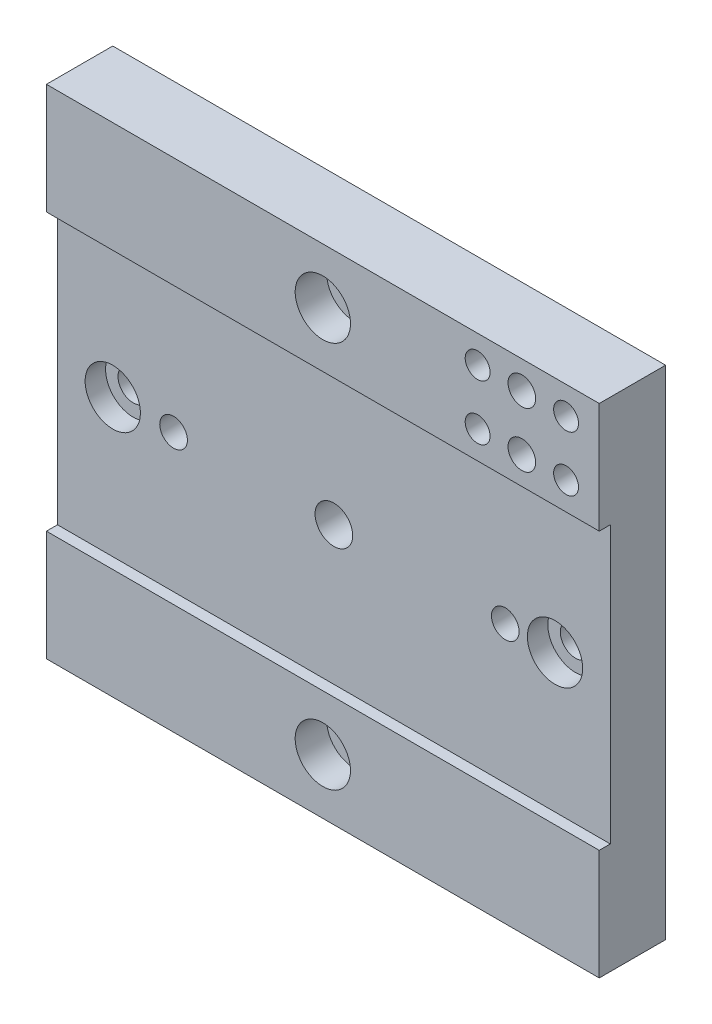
ISO-10303-21;
HEADER;
FILE_DESCRIPTION(('STEP AP214'),'2;1');
FILE_NAME('part.step','',(''),(''),'','','');
FILE_SCHEMA(('AUTOMOTIVE_DESIGN { 1 0 10303 214 1 1 1 1 }'));
ENDSEC;
DATA;
#1=APPLICATION_CONTEXT('core data for automotive mechanical design processes');
#2=APPLICATION_PROTOCOL_DEFINITION('international standard','automotive_design',2000,#1);
#3=PRODUCT_CONTEXT('',#1,'mechanical');
#4=PRODUCT('Part','Part','',(#3));
#5=PRODUCT_RELATED_PRODUCT_CATEGORY('part','',(#4));
#6=PRODUCT_DEFINITION_FORMATION('','',#4);
#7=PRODUCT_DEFINITION_CONTEXT('part definition',#1,'design');
#8=PRODUCT_DEFINITION('design','',#6,#7);
#9=PRODUCT_DEFINITION_SHAPE('','',#8);
#10=(LENGTH_UNIT() NAMED_UNIT(*) SI_UNIT(.MILLI.,.METRE.));
#11=(NAMED_UNIT(*) PLANE_ANGLE_UNIT() SI_UNIT($,.RADIAN.));
#12=(NAMED_UNIT(*) SI_UNIT($,.STERADIAN.) SOLID_ANGLE_UNIT());
#13=UNCERTAINTY_MEASURE_WITH_UNIT(LENGTH_MEASURE(1.E-05),#10,'distance_accuracy_value','');
#14=(GEOMETRIC_REPRESENTATION_CONTEXT(3) GLOBAL_UNCERTAINTY_ASSIGNED_CONTEXT((#13)) GLOBAL_UNIT_ASSIGNED_CONTEXT((#10,
#11,#12)) REPRESENTATION_CONTEXT('',''));
#15=CARTESIAN_POINT('',(0.,0.,0.));
#16=DIRECTION('',(0.,0.,1.));
#17=DIRECTION('',(1.,0.,0.));
#18=AXIS2_PLACEMENT_3D('',#15,#16,#17);
#19=CARTESIAN_POINT('',(0.,0.,12.));
#20=DIRECTION('',(0.,0.,-1.));
#21=DIRECTION('',(-1.,0.,0.));
#22=AXIS2_PLACEMENT_3D('',#19,#20,#21);
#23=PLANE('',#22);
#24=CARTESIAN_POINT('',(-395.662294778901,73.7263282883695,12.));
#25=DIRECTION('',(0.,0.,1.));
#26=DIRECTION('',(1.,0.,0.));
#27=AXIS2_PLACEMENT_3D('',#24,#25,#26);
#28=CIRCLE('',#27,5.);
#29=CARTESIAN_POINT('',(-390.662294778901,73.7263282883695,12.));
#30=VERTEX_POINT('',#29);
#31=EDGE_CURVE('E154',#30,#30,#28,.T.);
#32=ORIENTED_EDGE('',*,*,#31,.F.);
#33=EDGE_LOOP('',(#32));
#34=FACE_BOUND('',#33,.T.);
#35=DIRECTION('',(0.,1.,0.));
#36=VECTOR('',#35,1.);
#37=CARTESIAN_POINT('',(-345.662294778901,153.72632828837,12.));
#38=LINE('',#37,#36);
#39=CARTESIAN_POINT('',(-345.662294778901,63.7263282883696,12.));
#40=VERTEX_POINT('',#39);
#41=CARTESIAN_POINT('',(-345.662294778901,83.7263282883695,12.));
#42=VERTEX_POINT('',#41);
#43=EDGE_CURVE('E210',#40,#42,#38,.T.);
#44=ORIENTED_EDGE('',*,*,#43,.T.);
#45=DIRECTION('',(-1.,0.,0.));
#46=VECTOR('',#45,1.);
#47=CARTESIAN_POINT('',(-345.662294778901,83.7263282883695,12.));
#48=LINE('',#47,#46);
#49=CARTESIAN_POINT('',(-445.662294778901,83.7263282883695,12.));
#50=VERTEX_POINT('',#49);
#51=EDGE_CURVE('E127',#42,#50,#48,.T.);
#52=ORIENTED_EDGE('',*,*,#51,.T.);
#53=DIRECTION('',(0.,-1.,0.));
#54=VECTOR('',#53,1.);
#55=CARTESIAN_POINT('',(-445.662294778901,153.72632828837,12.));
#56=LINE('',#55,#54);
#57=CARTESIAN_POINT('',(-445.662294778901,63.7263282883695,12.));
#58=VERTEX_POINT('',#57);
#59=EDGE_CURVE('E71',#50,#58,#56,.T.);
#60=ORIENTED_EDGE('',*,*,#59,.T.);
#61=DIRECTION('',(1.,0.,0.));
#62=VECTOR('',#61,1.);
#63=CARTESIAN_POINT('',(-345.662294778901,63.7263282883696,12.));
#64=LINE('',#63,#62);
#65=EDGE_CURVE('E208',#58,#40,#64,.T.);
#66=ORIENTED_EDGE('',*,*,#65,.T.);
#67=EDGE_LOOP('',(#44,#52,#60,#66));
#68=FACE_BOUND('',#67,.T.);
#69=ADVANCED_FACE('F16',(#34,#68),#23,.F.);
#70=CARTESIAN_POINT('',(-445.662294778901,153.72632828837,12.));
#71=DIRECTION('',(1.,0.,0.));
#72=DIRECTION('',(0.,0.,-1.));
#73=AXIS2_PLACEMENT_3D('',#70,#71,#72);
#74=PLANE('',#73);
#75=ORIENTED_EDGE('',*,*,#59,.F.);
#76=DIRECTION('',(0.,0.,1.));
#77=VECTOR('',#76,1.);
#78=CARTESIAN_POINT('',(-445.662294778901,83.7263282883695,12.));
#79=LINE('',#78,#77);
#80=CARTESIAN_POINT('',(-445.662294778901,83.7263282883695,10.));
#81=VERTEX_POINT('',#80);
#82=EDGE_CURVE('E116',#81,#50,#79,.T.);
#83=ORIENTED_EDGE('',*,*,#82,.F.);
#84=DIRECTION('',(0.,-1.,0.));
#85=VECTOR('',#84,1.);
#86=CARTESIAN_POINT('',(-445.662294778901,83.7263282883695,10.));
#87=LINE('',#86,#85);
#88=CARTESIAN_POINT('',(-445.662294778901,133.726328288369,10.));
#89=VERTEX_POINT('',#88);
#90=EDGE_CURVE('E118',#89,#81,#87,.T.);
#91=ORIENTED_EDGE('',*,*,#90,.F.);
#92=DIRECTION('',(0.,0.,-1.));
#93=VECTOR('',#92,1.);
#94=CARTESIAN_POINT('',(-445.662294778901,133.726328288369,12.));
#95=LINE('',#94,#93);
#96=CARTESIAN_POINT('',(-445.662294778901,133.726328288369,12.));
#97=VERTEX_POINT('',#96);
#98=EDGE_CURVE('E96',#97,#89,#95,.T.);
#99=ORIENTED_EDGE('',*,*,#98,.F.);
#100=CARTESIAN_POINT('',(-445.662294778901,153.72632828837,12.));
#101=VERTEX_POINT('',#100);
#102=EDGE_CURVE('E206',#101,#97,#56,.T.);
#103=ORIENTED_EDGE('',*,*,#102,.F.);
#104=DIRECTION('',(0.,0.,-1.));
#105=VECTOR('',#104,1.);
#106=CARTESIAN_POINT('',(-445.662294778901,153.72632828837,12.));
#107=LINE('',#106,#105);
#108=CARTESIAN_POINT('',(-445.662294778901,153.72632828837,0.));
#109=VERTEX_POINT('',#108);
#110=EDGE_CURVE('E214',#101,#109,#107,.T.);
#111=ORIENTED_EDGE('',*,*,#110,.T.);
#112=DIRECTION('',(0.,-1.,0.));
#113=VECTOR('',#112,1.);
#114=CARTESIAN_POINT('',(-445.662294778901,153.72632828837,0.));
#115=LINE('',#114,#113);
#116=CARTESIAN_POINT('',(-445.662294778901,63.7263282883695,0.));
#117=VERTEX_POINT('',#116);
#118=EDGE_CURVE('E203',#109,#117,#115,.T.);
#119=ORIENTED_EDGE('',*,*,#118,.T.);
#120=DIRECTION('',(0.,0.,-1.));
#121=VECTOR('',#120,1.);
#122=CARTESIAN_POINT('',(-445.662294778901,63.7263282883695,12.));
#123=LINE('',#122,#121);
#124=EDGE_CURVE('E11',#58,#117,#123,.T.);
#125=ORIENTED_EDGE('',*,*,#124,.F.);
#126=EDGE_LOOP('',(#75,#83,#91,#99,#103,#111,#119,#125));
#127=FACE_BOUND('',#126,.T.);
#128=ADVANCED_FACE('F18',(#127),#74,.F.);
#129=CARTESIAN_POINT('',(-345.662294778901,63.7263282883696,12.));
#130=DIRECTION('',(0.,1.,0.));
#131=DIRECTION('',(-1.,0.,0.));
#132=AXIS2_PLACEMENT_3D('',#129,#130,#131);
#133=PLANE('',#132);
#134=DIRECTION('',(1.,0.,0.));
#135=VECTOR('',#134,1.);
#136=CARTESIAN_POINT('',(-345.662294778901,63.7263282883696,0.));
#137=LINE('',#136,#135);
#138=CARTESIAN_POINT('',(-345.662294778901,63.7263282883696,0.));
#139=VERTEX_POINT('',#138);
#140=EDGE_CURVE('E217',#117,#139,#137,.T.);
#141=ORIENTED_EDGE('',*,*,#140,.T.);
#142=DIRECTION('',(0.,0.,-1.));
#143=VECTOR('',#142,1.);
#144=CARTESIAN_POINT('',(-345.662294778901,63.7263282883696,12.));
#145=LINE('',#144,#143);
#146=EDGE_CURVE('E25',#40,#139,#145,.T.);
#147=ORIENTED_EDGE('',*,*,#146,.F.);
#148=ORIENTED_EDGE('',*,*,#65,.F.);
#149=ORIENTED_EDGE('',*,*,#124,.T.);
#150=EDGE_LOOP('',(#141,#147,#148,#149));
#151=FACE_BOUND('',#150,.T.);
#152=ADVANCED_FACE('F265',(#151),#133,.F.);
#153=CARTESIAN_POINT('',(-345.662294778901,153.72632828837,12.));
#154=DIRECTION('',(-1.,0.,0.));
#155=DIRECTION('',(0.,-1.,0.));
#156=AXIS2_PLACEMENT_3D('',#153,#154,#155);
#157=PLANE('',#156);
#158=DIRECTION('',(0.,-1.,0.));
#159=VECTOR('',#158,1.);
#160=CARTESIAN_POINT('',(-345.662294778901,83.7263282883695,10.));
#161=LINE('',#160,#159);
#162=CARTESIAN_POINT('',(-345.662294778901,133.726328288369,10.));
#163=VERTEX_POINT('',#162);
#164=CARTESIAN_POINT('',(-345.662294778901,83.7263282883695,10.));
#165=VERTEX_POINT('',#164);
#166=EDGE_CURVE('E104',#163,#165,#161,.T.);
#167=ORIENTED_EDGE('',*,*,#166,.T.);
#168=DIRECTION('',(0.,0.,1.));
#169=VECTOR('',#168,1.);
#170=CARTESIAN_POINT('',(-345.662294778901,83.7263282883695,12.));
#171=LINE('',#170,#169);
#172=EDGE_CURVE('E110',#165,#42,#171,.T.);
#173=ORIENTED_EDGE('',*,*,#172,.T.);
#174=ORIENTED_EDGE('',*,*,#43,.F.);
#175=ORIENTED_EDGE('',*,*,#146,.T.);
#176=DIRECTION('',(0.,1.,0.));
#177=VECTOR('',#176,1.);
#178=CARTESIAN_POINT('',(-345.662294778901,153.72632828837,0.));
#179=LINE('',#178,#177);
#180=CARTESIAN_POINT('',(-345.662294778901,153.72632828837,0.));
#181=VERTEX_POINT('',#180);
#182=EDGE_CURVE('E219',#139,#181,#179,.T.);
#183=ORIENTED_EDGE('',*,*,#182,.T.);
#184=DIRECTION('',(0.,0.,-1.));
#185=VECTOR('',#184,1.);
#186=CARTESIAN_POINT('',(-345.662294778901,153.72632828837,12.));
#187=LINE('',#186,#185);
#188=CARTESIAN_POINT('',(-345.662294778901,153.72632828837,12.));
#189=VERTEX_POINT('',#188);
#190=EDGE_CURVE('E223',#189,#181,#187,.T.);
#191=ORIENTED_EDGE('',*,*,#190,.F.);
#192=CARTESIAN_POINT('',(-345.662294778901,133.726328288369,12.));
#193=VERTEX_POINT('',#192);
#194=EDGE_CURVE('E115',#193,#189,#38,.T.);
#195=ORIENTED_EDGE('',*,*,#194,.F.);
#196=DIRECTION('',(0.,0.,-1.));
#197=VECTOR('',#196,1.);
#198=CARTESIAN_POINT('',(-345.662294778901,133.726328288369,12.));
#199=LINE('',#198,#197);
#200=EDGE_CURVE('E33',#193,#163,#199,.T.);
#201=ORIENTED_EDGE('',*,*,#200,.T.);
#202=EDGE_LOOP('',(#167,#173,#174,#175,#183,#191,#195,#201));
#203=FACE_BOUND('',#202,.T.);
#204=ADVANCED_FACE('F113',(#203),#157,.F.);
#205=CARTESIAN_POINT('',(-345.662294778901,153.72632828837,12.));
#206=DIRECTION('',(0.,-1.,0.));
#207=DIRECTION('',(0.,0.,-1.));
#208=AXIS2_PLACEMENT_3D('',#205,#206,#207);
#209=PLANE('',#208);
#210=DIRECTION('',(-1.,0.,0.));
#211=VECTOR('',#210,1.);
#212=CARTESIAN_POINT('',(-345.662294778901,153.72632828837,0.));
#213=LINE('',#212,#211);
#214=EDGE_CURVE('E63',#181,#109,#213,.T.);
#215=ORIENTED_EDGE('',*,*,#214,.T.);
#216=ORIENTED_EDGE('',*,*,#110,.F.);
#217=DIRECTION('',(-1.,0.,0.));
#218=VECTOR('',#217,1.);
#219=CARTESIAN_POINT('',(-345.662294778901,153.72632828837,12.));
#220=LINE('',#219,#218);
#221=EDGE_CURVE('E42',#189,#101,#220,.T.);
#222=ORIENTED_EDGE('',*,*,#221,.F.);
#223=ORIENTED_EDGE('',*,*,#190,.T.);
#224=EDGE_LOOP('',(#215,#216,#222,#223));
#225=FACE_BOUND('',#224,.T.);
#226=ADVANCED_FACE('F272',(#225),#209,.F.);
#227=CARTESIAN_POINT('',(-359.662294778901,138.726328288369,12.));
#228=DIRECTION('',(0.,0.,-1.));
#229=DIRECTION('',(-1.,0.,0.));
#230=AXIS2_PLACEMENT_3D('',#227,#228,#229);
#231=CIRCLE('',#230,2.5);
#232=CARTESIAN_POINT('',(-362.162294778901,138.726328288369,12.));
#233=VERTEX_POINT('',#232);
#234=EDGE_CURVE('E285',#233,#233,#231,.T.);
#235=ORIENTED_EDGE('',*,*,#234,.T.);
#236=EDGE_LOOP('',(#235));
#237=FACE_BOUND('',#236,.T.);
#238=CARTESIAN_POINT('',(-359.662294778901,148.72632828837,12.));
#239=DIRECTION('',(0.,0.,-1.));
#240=DIRECTION('',(-1.,0.,0.));
#241=AXIS2_PLACEMENT_3D('',#238,#239,#240);
#242=CIRCLE('',#241,2.5);
#243=CARTESIAN_POINT('',(-362.162294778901,148.72632828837,12.));
#244=VERTEX_POINT('',#243);
#245=EDGE_CURVE('E289',#244,#244,#242,.T.);
#246=ORIENTED_EDGE('',*,*,#245,.T.);
#247=EDGE_LOOP('',(#246));
#248=FACE_BOUND('',#247,.T.);
#249=CARTESIAN_POINT('',(-351.662294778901,148.72632828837,12.));
#250=DIRECTION('',(0.,0.,-1.));
#251=DIRECTION('',(-1.,0.,0.));
#252=AXIS2_PLACEMENT_3D('',#249,#250,#251);
#253=CIRCLE('',#252,2.24999999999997);
#254=CARTESIAN_POINT('',(-353.912294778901,148.72632828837,12.));
#255=VERTEX_POINT('',#254);
#256=EDGE_CURVE('E293',#255,#255,#253,.T.);
#257=ORIENTED_EDGE('',*,*,#256,.T.);
#258=EDGE_LOOP('',(#257));
#259=FACE_BOUND('',#258,.T.);
#260=CARTESIAN_POINT('',(-351.662294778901,138.726328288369,12.));
#261=DIRECTION('',(0.,0.,-1.));
#262=DIRECTION('',(-1.,0.,0.));
#263=AXIS2_PLACEMENT_3D('',#260,#261,#262);
#264=CIRCLE('',#263,2.24999999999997);
#265=CARTESIAN_POINT('',(-353.9122947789,138.726328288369,12.));
#266=VERTEX_POINT('',#265);
#267=EDGE_CURVE('E297',#266,#266,#264,.T.);
#268=ORIENTED_EDGE('',*,*,#267,.T.);
#269=EDGE_LOOP('',(#268));
#270=FACE_BOUND('',#269,.T.);
#271=CARTESIAN_POINT('',(-367.662294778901,138.726328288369,12.));
#272=DIRECTION('',(0.,0.,-1.));
#273=DIRECTION('',(-1.,0.,0.));
#274=AXIS2_PLACEMENT_3D('',#271,#272,#273);
#275=CIRCLE('',#274,2.24999999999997);
#276=CARTESIAN_POINT('',(-369.912294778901,138.726328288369,12.));
#277=VERTEX_POINT('',#276);
#278=EDGE_CURVE('E301',#277,#277,#275,.T.);
#279=ORIENTED_EDGE('',*,*,#278,.T.);
#280=EDGE_LOOP('',(#279));
#281=FACE_BOUND('',#280,.T.);
#282=CARTESIAN_POINT('',(-367.662294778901,148.72632828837,12.));
#283=DIRECTION('',(0.,0.,-1.));
#284=DIRECTION('',(-1.,0.,0.));
#285=AXIS2_PLACEMENT_3D('',#282,#283,#284);
#286=CIRCLE('',#285,2.24999999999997);
#287=CARTESIAN_POINT('',(-369.912294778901,148.72632828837,12.));
#288=VERTEX_POINT('',#287);
#289=EDGE_CURVE('E305',#288,#288,#286,.T.);
#290=ORIENTED_EDGE('',*,*,#289,.T.);
#291=EDGE_LOOP('',(#290));
#292=FACE_BOUND('',#291,.T.);
#293=CARTESIAN_POINT('',(-395.662294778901,143.726328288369,12.));
#294=DIRECTION('',(0.,0.,1.));
#295=DIRECTION('',(1.,0.,0.));
#296=AXIS2_PLACEMENT_3D('',#293,#294,#295);
#297=CIRCLE('',#296,5.);
#298=CARTESIAN_POINT('',(-390.662294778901,143.726328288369,12.));
#299=VERTEX_POINT('',#298);
#300=EDGE_CURVE('E164',#299,#299,#297,.T.);
#301=ORIENTED_EDGE('',*,*,#300,.F.);
#302=EDGE_LOOP('',(#301));
#303=FACE_BOUND('',#302,.T.);
#304=ORIENTED_EDGE('',*,*,#102,.T.);
#305=DIRECTION('',(-1.,0.,0.));
#306=VECTOR('',#305,1.);
#307=CARTESIAN_POINT('',(-345.662294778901,133.726328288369,12.));
#308=LINE('',#307,#306);
#309=EDGE_CURVE('E101',#193,#97,#308,.T.);
#310=ORIENTED_EDGE('',*,*,#309,.F.);
#311=ORIENTED_EDGE('',*,*,#194,.T.);
#312=ORIENTED_EDGE('',*,*,#221,.T.);
#313=EDGE_LOOP('',(#304,#310,#311,#312));
#314=FACE_BOUND('',#313,.T.);
#315=ADVANCED_FACE('F260',(#237,#248,#259,#270,#281,#292,#303,#314),#23,.F.);
#316=CARTESIAN_POINT('',(0.,0.,0.));
#317=DIRECTION('',(0.,0.,-1.));
#318=DIRECTION('',(-1.,0.,0.));
#319=AXIS2_PLACEMENT_3D('',#316,#317,#318);
#320=PLANE('',#319);
#321=CARTESIAN_POINT('',(-359.662294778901,138.726328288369,0.));
#322=DIRECTION('',(0.,0.,-1.));
#323=DIRECTION('',(-1.,0.,0.));
#324=AXIS2_PLACEMENT_3D('',#321,#322,#323);
#325=CIRCLE('',#324,2.5);
#326=CARTESIAN_POINT('',(-362.162294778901,138.726328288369,0.));
#327=VERTEX_POINT('',#326);
#328=EDGE_CURVE('E734',#327,#327,#325,.T.);
#329=ORIENTED_EDGE('',*,*,#328,.F.);
#330=EDGE_LOOP('',(#329));
#331=FACE_BOUND('',#330,.T.);
#332=CARTESIAN_POINT('',(-359.662294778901,148.72632828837,0.));
#333=DIRECTION('',(0.,0.,-1.));
#334=DIRECTION('',(-1.,0.,0.));
#335=AXIS2_PLACEMENT_3D('',#332,#333,#334);
#336=CIRCLE('',#335,2.5);
#337=CARTESIAN_POINT('',(-362.162294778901,148.72632828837,0.));
#338=VERTEX_POINT('',#337);
#339=EDGE_CURVE('E736',#338,#338,#336,.T.);
#340=ORIENTED_EDGE('',*,*,#339,.F.);
#341=EDGE_LOOP('',(#340));
#342=FACE_BOUND('',#341,.T.);
#343=CARTESIAN_POINT('',(-351.662294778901,148.72632828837,0.));
#344=DIRECTION('',(0.,0.,-1.));
#345=DIRECTION('',(-1.,0.,0.));
#346=AXIS2_PLACEMENT_3D('',#343,#344,#345);
#347=CIRCLE('',#346,4.);
#348=CARTESIAN_POINT('',(-355.662294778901,148.72632828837,0.));
#349=VERTEX_POINT('',#348);
#350=EDGE_CURVE('E742',#349,#349,#347,.T.);
#351=ORIENTED_EDGE('',*,*,#350,.F.);
#352=EDGE_LOOP('',(#351));
#353=FACE_BOUND('',#352,.T.);
#354=CARTESIAN_POINT('',(-351.662294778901,138.726328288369,0.));
#355=DIRECTION('',(0.,0.,-1.));
#356=DIRECTION('',(-1.,0.,0.));
#357=AXIS2_PLACEMENT_3D('',#354,#355,#356);
#358=CIRCLE('',#357,4.);
#359=CARTESIAN_POINT('',(-355.662294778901,138.726328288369,0.));
#360=VERTEX_POINT('',#359);
#361=EDGE_CURVE('E752',#360,#360,#358,.T.);
#362=ORIENTED_EDGE('',*,*,#361,.F.);
#363=EDGE_LOOP('',(#362));
#364=FACE_BOUND('',#363,.T.);
#365=CARTESIAN_POINT('',(-367.662294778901,138.726328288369,0.));
#366=DIRECTION('',(0.,0.,-1.));
#367=DIRECTION('',(-1.,0.,0.));
#368=AXIS2_PLACEMENT_3D('',#365,#366,#367);
#369=CIRCLE('',#368,4.);
#370=CARTESIAN_POINT('',(-371.662294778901,138.726328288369,0.));
#371=VERTEX_POINT('',#370);
#372=EDGE_CURVE('E762',#371,#371,#369,.T.);
#373=ORIENTED_EDGE('',*,*,#372,.F.);
#374=EDGE_LOOP('',(#373));
#375=FACE_BOUND('',#374,.T.);
#376=CARTESIAN_POINT('',(-367.662294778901,148.72632828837,0.));
#377=DIRECTION('',(0.,0.,-1.));
#378=DIRECTION('',(-1.,0.,0.));
#379=AXIS2_PLACEMENT_3D('',#376,#377,#378);
#380=CIRCLE('',#379,4.);
#381=CARTESIAN_POINT('',(-371.662294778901,148.72632828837,0.));
#382=VERTEX_POINT('',#381);
#383=EDGE_CURVE('E772',#382,#382,#380,.T.);
#384=ORIENTED_EDGE('',*,*,#383,.F.);
#385=EDGE_LOOP('',(#384));
#386=FACE_BOUND('',#385,.T.);
#387=CARTESIAN_POINT('',(-395.662294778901,108.726328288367,0.));
#388=DIRECTION('',(0.,0.,-1.));
#389=DIRECTION('',(-1.,0.,0.));
#390=AXIS2_PLACEMENT_3D('',#387,#388,#389);
#391=CIRCLE('',#390,3.4);
#392=CARTESIAN_POINT('',(-399.062294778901,108.726328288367,0.));
#393=VERTEX_POINT('',#392);
#394=EDGE_CURVE('E121',#393,#393,#391,.T.);
#395=ORIENTED_EDGE('',*,*,#394,.F.);
#396=EDGE_LOOP('',(#395));
#397=FACE_BOUND('',#396,.T.);
#398=CARTESIAN_POINT('',(-364.661852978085,108.72632828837,0.));
#399=DIRECTION('',(0.,0.,1.));
#400=DIRECTION('',(1.,0.,0.));
#401=AXIS2_PLACEMENT_3D('',#398,#399,#400);
#402=CIRCLE('',#401,2.5);
#403=CARTESIAN_POINT('',(-362.161852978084,108.72632828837,0.));
#404=VERTEX_POINT('',#403);
#405=EDGE_CURVE('E141',#404,#404,#402,.T.);
#406=ORIENTED_EDGE('',*,*,#405,.T.);
#407=EDGE_LOOP('',(#406));
#408=FACE_BOUND('',#407,.T.);
#409=CARTESIAN_POINT('',(-424.661852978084,108.726328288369,0.));
#410=DIRECTION('',(0.,0.,1.));
#411=DIRECTION('',(1.,0.,0.));
#412=AXIS2_PLACEMENT_3D('',#409,#410,#411);
#413=CIRCLE('',#412,2.5);
#414=CARTESIAN_POINT('',(-422.161852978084,108.726328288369,0.));
#415=VERTEX_POINT('',#414);
#416=EDGE_CURVE('E144',#415,#415,#413,.T.);
#417=ORIENTED_EDGE('',*,*,#416,.T.);
#418=EDGE_LOOP('',(#417));
#419=FACE_BOUND('',#418,.T.);
#420=CARTESIAN_POINT('',(-435.662294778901,108.72632828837,0.));
#421=DIRECTION('',(0.,0.,-1.));
#422=DIRECTION('',(-1.,0.,0.));
#423=AXIS2_PLACEMENT_3D('',#420,#421,#422);
#424=CIRCLE('',#423,5.);
#425=CARTESIAN_POINT('',(-440.662294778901,108.72632828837,0.));
#426=VERTEX_POINT('',#425);
#427=EDGE_CURVE('E185',#426,#426,#424,.T.);
#428=ORIENTED_EDGE('',*,*,#427,.F.);
#429=EDGE_LOOP('',(#428));
#430=FACE_BOUND('',#429,.T.);
#431=CARTESIAN_POINT('',(-395.662294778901,73.7263282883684,0.));
#432=DIRECTION('',(0.,0.,-1.));
#433=DIRECTION('',(-1.,0.,0.));
#434=AXIS2_PLACEMENT_3D('',#431,#432,#433);
#435=CIRCLE('',#434,5.);
#436=CARTESIAN_POINT('',(-400.662294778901,73.7263282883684,0.));
#437=VERTEX_POINT('',#436);
#438=EDGE_CURVE('E184',#437,#437,#435,.T.);
#439=ORIENTED_EDGE('',*,*,#438,.F.);
#440=EDGE_LOOP('',(#439));
#441=FACE_BOUND('',#440,.T.);
#442=CARTESIAN_POINT('',(-355.662294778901,108.72632828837,0.));
#443=DIRECTION('',(0.,0.,-1.));
#444=DIRECTION('',(-1.,0.,0.));
#445=AXIS2_PLACEMENT_3D('',#442,#443,#444);
#446=CIRCLE('',#445,5.);
#447=CARTESIAN_POINT('',(-360.662294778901,108.72632828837,0.));
#448=VERTEX_POINT('',#447);
#449=EDGE_CURVE('E191',#448,#448,#446,.T.);
#450=ORIENTED_EDGE('',*,*,#449,.F.);
#451=EDGE_LOOP('',(#450));
#452=FACE_BOUND('',#451,.T.);
#453=CARTESIAN_POINT('',(-395.662294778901,143.726328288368,0.));
#454=DIRECTION('',(0.,0.,-1.));
#455=DIRECTION('',(-1.,0.,0.));
#456=AXIS2_PLACEMENT_3D('',#453,#454,#455);
#457=CIRCLE('',#456,5.);
#458=CARTESIAN_POINT('',(-400.662294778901,143.726328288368,0.));
#459=VERTEX_POINT('',#458);
#460=EDGE_CURVE('E197',#459,#459,#457,.T.);
#461=ORIENTED_EDGE('',*,*,#460,.F.);
#462=EDGE_LOOP('',(#461));
#463=FACE_BOUND('',#462,.T.);
#464=ORIENTED_EDGE('',*,*,#118,.F.);
#465=ORIENTED_EDGE('',*,*,#214,.F.);
#466=ORIENTED_EDGE('',*,*,#182,.F.);
#467=ORIENTED_EDGE('',*,*,#140,.F.);
#468=EDGE_LOOP('',(#464,#465,#466,#467));
#469=FACE_BOUND('',#468,.T.);
#470=ADVANCED_FACE('F271',(#331,#342,#353,#364,#375,#386,#397,#408,#419,#430,#441,#452,#463,
#469),#320,.T.);
#471=CARTESIAN_POINT('',(-395.662294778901,143.726328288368,2.));
#472=DIRECTION('',(0.,0.,-1.));
#473=DIRECTION('',(-1.,0.,0.));
#474=AXIS2_PLACEMENT_3D('',#471,#472,#473);
#475=CYLINDRICAL_SURFACE('',#474,5.);
#476=CARTESIAN_POINT('',(-395.662294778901,143.726328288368,2.));
#477=DIRECTION('',(0.,0.,-1.));
#478=DIRECTION('',(-1.,0.,0.));
#479=AXIS2_PLACEMENT_3D('',#476,#477,#478);
#480=CIRCLE('',#479,5.);
#481=CARTESIAN_POINT('',(-400.662294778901,143.726328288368,2.));
#482=VERTEX_POINT('',#481);
#483=EDGE_CURVE('E200',#482,#482,#480,.T.);
#484=ORIENTED_EDGE('',*,*,#483,.F.);
#485=EDGE_LOOP('',(#484));
#486=FACE_BOUND('',#485,.T.);
#487=ORIENTED_EDGE('',*,*,#460,.T.);
#488=EDGE_LOOP('',(#487));
#489=FACE_BOUND('',#488,.T.);
#490=ADVANCED_FACE('F279',(#486,#489),#475,.F.);
#491=CARTESIAN_POINT('',(-395.662294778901,143.726328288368,2.));
#492=DIRECTION('',(0.,0.,-1.));
#493=DIRECTION('',(-1.,0.,0.));
#494=AXIS2_PLACEMENT_3D('',#491,#492,#493);
#495=PLANE('',#494);
#496=CARTESIAN_POINT('',(-395.662294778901,143.726328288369,2.));
#497=DIRECTION('',(0.,0.,-1.));
#498=DIRECTION('',(-1.,0.,0.));
#499=AXIS2_PLACEMENT_3D('',#496,#497,#498);
#500=CIRCLE('',#499,2.75);
#501=CARTESIAN_POINT('',(-398.412294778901,143.726328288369,2.));
#502=VERTEX_POINT('',#501);
#503=EDGE_CURVE('E173',#502,#502,#500,.T.);
#504=ORIENTED_EDGE('',*,*,#503,.F.);
#505=EDGE_LOOP('',(#504));
#506=FACE_BOUND('',#505,.T.);
#507=ORIENTED_EDGE('',*,*,#483,.T.);
#508=EDGE_LOOP('',(#507));
#509=FACE_BOUND('',#508,.T.);
#510=ADVANCED_FACE('F354',(#506,#509),#495,.T.);
#511=CARTESIAN_POINT('',(-355.662294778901,108.72632828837,2.));
#512=DIRECTION('',(0.,0.,-1.));
#513=DIRECTION('',(-1.,0.,0.));
#514=AXIS2_PLACEMENT_3D('',#511,#512,#513);
#515=CYLINDRICAL_SURFACE('',#514,5.);
#516=CARTESIAN_POINT('',(-355.662294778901,108.72632828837,2.));
#517=DIRECTION('',(0.,0.,-1.));
#518=DIRECTION('',(-1.,0.,0.));
#519=AXIS2_PLACEMENT_3D('',#516,#517,#518);
#520=CIRCLE('',#519,5.);
#521=CARTESIAN_POINT('',(-360.662294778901,108.72632828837,2.));
#522=VERTEX_POINT('',#521);
#523=EDGE_CURVE('E194',#522,#522,#520,.T.);
#524=ORIENTED_EDGE('',*,*,#523,.F.);
#525=EDGE_LOOP('',(#524));
#526=FACE_BOUND('',#525,.T.);
#527=ORIENTED_EDGE('',*,*,#449,.T.);
#528=EDGE_LOOP('',(#527));
#529=FACE_BOUND('',#528,.T.);
#530=ADVANCED_FACE('F364',(#526,#529),#515,.F.);
#531=CARTESIAN_POINT('',(-355.662294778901,108.72632828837,2.));
#532=DIRECTION('',(0.,0.,-1.));
#533=DIRECTION('',(-1.,0.,0.));
#534=AXIS2_PLACEMENT_3D('',#531,#532,#533);
#535=PLANE('',#534);
#536=CARTESIAN_POINT('',(-355.662294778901,108.726328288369,2.));
#537=DIRECTION('',(0.,0.,-1.));
#538=DIRECTION('',(-1.,0.,0.));
#539=AXIS2_PLACEMENT_3D('',#536,#537,#538);
#540=CIRCLE('',#539,2.75);
#541=CARTESIAN_POINT('',(-358.412294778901,108.726328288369,2.));
#542=VERTEX_POINT('',#541);
#543=EDGE_CURVE('E153',#542,#542,#540,.T.);
#544=ORIENTED_EDGE('',*,*,#543,.F.);
#545=EDGE_LOOP('',(#544));
#546=FACE_BOUND('',#545,.T.);
#547=ORIENTED_EDGE('',*,*,#523,.T.);
#548=EDGE_LOOP('',(#547));
#549=FACE_BOUND('',#548,.T.);
#550=ADVANCED_FACE('F375',(#546,#549),#535,.T.);
#551=CARTESIAN_POINT('',(-395.662294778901,73.7263282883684,2.));
#552=DIRECTION('',(0.,0.,-1.));
#553=DIRECTION('',(-1.,0.,0.));
#554=AXIS2_PLACEMENT_3D('',#551,#552,#553);
#555=CYLINDRICAL_SURFACE('',#554,5.);
#556=CARTESIAN_POINT('',(-395.662294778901,73.7263282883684,2.));
#557=DIRECTION('',(0.,0.,-1.));
#558=DIRECTION('',(-1.,0.,0.));
#559=AXIS2_PLACEMENT_3D('',#556,#557,#558);
#560=CIRCLE('',#559,5.);
#561=CARTESIAN_POINT('',(-400.662294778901,73.7263282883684,2.));
#562=VERTEX_POINT('',#561);
#563=EDGE_CURVE('E188',#562,#562,#560,.T.);
#564=ORIENTED_EDGE('',*,*,#563,.F.);
#565=EDGE_LOOP('',(#564));
#566=FACE_BOUND('',#565,.T.);
#567=ORIENTED_EDGE('',*,*,#438,.T.);
#568=EDGE_LOOP('',(#567));
#569=FACE_BOUND('',#568,.T.);
#570=ADVANCED_FACE('F385',(#566,#569),#555,.F.);
#571=CARTESIAN_POINT('',(-395.662294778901,73.7263282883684,2.));
#572=DIRECTION('',(0.,0.,-1.));
#573=DIRECTION('',(-1.,0.,0.));
#574=AXIS2_PLACEMENT_3D('',#571,#572,#573);
#575=PLANE('',#574);
#576=CARTESIAN_POINT('',(-395.662294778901,73.7263282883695,2.));
#577=DIRECTION('',(0.,0.,-1.));
#578=DIRECTION('',(-1.,0.,0.));
#579=AXIS2_PLACEMENT_3D('',#576,#577,#578);
#580=CIRCLE('',#579,2.75);
#581=CARTESIAN_POINT('',(-398.412294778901,73.7263282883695,2.));
#582=VERTEX_POINT('',#581);
#583=EDGE_CURVE('E163',#582,#582,#580,.T.);
#584=ORIENTED_EDGE('',*,*,#583,.F.);
#585=EDGE_LOOP('',(#584));
#586=FACE_BOUND('',#585,.T.);
#587=ORIENTED_EDGE('',*,*,#563,.T.);
#588=EDGE_LOOP('',(#587));
#589=FACE_BOUND('',#588,.T.);
#590=ADVANCED_FACE('F395',(#586,#589),#575,.T.);
#591=CARTESIAN_POINT('',(-435.662294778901,108.72632828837,2.));
#592=DIRECTION('',(0.,0.,-1.));
#593=DIRECTION('',(-1.,0.,0.));
#594=AXIS2_PLACEMENT_3D('',#591,#592,#593);
#595=CYLINDRICAL_SURFACE('',#594,5.);
#596=CARTESIAN_POINT('',(-435.662294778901,108.72632828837,2.));
#597=DIRECTION('',(0.,0.,-1.));
#598=DIRECTION('',(-1.,0.,0.));
#599=AXIS2_PLACEMENT_3D('',#596,#597,#598);
#600=CIRCLE('',#599,5.);
#601=CARTESIAN_POINT('',(-440.662294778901,108.72632828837,2.));
#602=VERTEX_POINT('',#601);
#603=EDGE_CURVE('E181',#602,#602,#600,.T.);
#604=ORIENTED_EDGE('',*,*,#603,.F.);
#605=EDGE_LOOP('',(#604));
#606=FACE_BOUND('',#605,.T.);
#607=ORIENTED_EDGE('',*,*,#427,.T.);
#608=EDGE_LOOP('',(#607));
#609=FACE_BOUND('',#608,.T.);
#610=ADVANCED_FACE('F404',(#606,#609),#595,.F.);
#611=CARTESIAN_POINT('',(-435.662294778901,108.72632828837,2.));
#612=DIRECTION('',(0.,0.,-1.));
#613=DIRECTION('',(-1.,0.,0.));
#614=AXIS2_PLACEMENT_3D('',#611,#612,#613);
#615=PLANE('',#614);
#616=CARTESIAN_POINT('',(-435.662294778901,108.726328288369,2.));
#617=DIRECTION('',(0.,0.,-1.));
#618=DIRECTION('',(-1.,0.,0.));
#619=AXIS2_PLACEMENT_3D('',#616,#617,#618);
#620=CIRCLE('',#619,2.75);
#621=CARTESIAN_POINT('',(-438.412294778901,108.726328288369,2.));
#622=VERTEX_POINT('',#621);
#623=EDGE_CURVE('E180',#622,#622,#620,.T.);
#624=ORIENTED_EDGE('',*,*,#623,.F.);
#625=EDGE_LOOP('',(#624));
#626=FACE_BOUND('',#625,.T.);
#627=ORIENTED_EDGE('',*,*,#603,.T.);
#628=EDGE_LOOP('',(#627));
#629=FACE_BOUND('',#628,.T.);
#630=ADVANCED_FACE('F414',(#626,#629),#615,.T.);
#631=CARTESIAN_POINT('',(-435.662294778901,108.726328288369,12.));
#632=DIRECTION('',(0.,0.,1.));
#633=DIRECTION('',(1.,0.,0.));
#634=AXIS2_PLACEMENT_3D('',#631,#632,#633);
#635=CYLINDRICAL_SURFACE('',#634,2.75);
#636=ORIENTED_EDGE('',*,*,#623,.T.);
#637=EDGE_LOOP('',(#636));
#638=FACE_BOUND('',#637,.T.);
#639=CARTESIAN_POINT('',(-435.662294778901,108.726328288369,6.3));
#640=DIRECTION('',(0.,0.,1.));
#641=DIRECTION('',(1.,0.,0.));
#642=AXIS2_PLACEMENT_3D('',#639,#640,#641);
#643=CIRCLE('',#642,2.75);
#644=CARTESIAN_POINT('',(-432.912294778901,108.726328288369,6.3));
#645=VERTEX_POINT('',#644);
#646=EDGE_CURVE('E177',#645,#645,#643,.T.);
#647=ORIENTED_EDGE('',*,*,#646,.T.);
#648=EDGE_LOOP('',(#647));
#649=FACE_BOUND('',#648,.T.);
#650=ADVANCED_FACE('F423',(#638,#649),#635,.F.);
#651=CARTESIAN_POINT('',(-432.912294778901,108.726328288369,6.3));
#652=DIRECTION('',(0.,0.,-1.));
#653=DIRECTION('',(-1.,0.,0.));
#654=AXIS2_PLACEMENT_3D('',#651,#652,#653);
#655=PLANE('',#654);
#656=ORIENTED_EDGE('',*,*,#646,.F.);
#657=EDGE_LOOP('',(#656));
#658=FACE_BOUND('',#657,.T.);
#659=CARTESIAN_POINT('',(-435.662294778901,108.726328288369,6.3));
#660=DIRECTION('',(0.,0.,1.));
#661=DIRECTION('',(1.,0.,0.));
#662=AXIS2_PLACEMENT_3D('',#659,#660,#661);
#663=CIRCLE('',#662,5.);
#664=CARTESIAN_POINT('',(-430.662294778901,108.726328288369,6.3));
#665=VERTEX_POINT('',#664);
#666=EDGE_CURVE('E174',#665,#665,#663,.T.);
#667=ORIENTED_EDGE('',*,*,#666,.T.);
#668=EDGE_LOOP('',(#667));
#669=FACE_BOUND('',#668,.T.);
#670=ADVANCED_FACE('F433',(#658,#669),#655,.F.);
#671=CARTESIAN_POINT('',(-435.662294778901,108.726328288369,12.));
#672=DIRECTION('',(0.,0.,1.));
#673=DIRECTION('',(1.,0.,0.));
#674=AXIS2_PLACEMENT_3D('',#671,#672,#673);
#675=CYLINDRICAL_SURFACE('',#674,5.);
#676=CARTESIAN_POINT('',(-435.662294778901,108.726328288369,10.));
#677=DIRECTION('',(0.,0.,-1.));
#678=DIRECTION('',(-1.,0.,0.));
#679=AXIS2_PLACEMENT_3D('',#676,#677,#678);
#680=CIRCLE('',#679,5.);
#681=CARTESIAN_POINT('',(-440.662294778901,108.726328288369,10.));
#682=VERTEX_POINT('',#681);
#683=EDGE_CURVE('E138',#682,#682,#680,.F.);
#684=ORIENTED_EDGE('',*,*,#683,.T.);
#685=EDGE_LOOP('',(#684));
#686=FACE_BOUND('',#685,.T.);
#687=ORIENTED_EDGE('',*,*,#666,.F.);
#688=EDGE_LOOP('',(#687));
#689=FACE_BOUND('',#688,.T.);
#690=ADVANCED_FACE('F443',(#686,#689),#675,.F.);
#691=CARTESIAN_POINT('',(-395.662294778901,143.726328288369,12.));
#692=DIRECTION('',(0.,0.,1.));
#693=DIRECTION('',(1.,0.,0.));
#694=AXIS2_PLACEMENT_3D('',#691,#692,#693);
#695=CYLINDRICAL_SURFACE('',#694,2.75);
#696=ORIENTED_EDGE('',*,*,#503,.T.);
#697=EDGE_LOOP('',(#696));
#698=FACE_BOUND('',#697,.T.);
#699=CARTESIAN_POINT('',(-395.662294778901,143.726328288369,6.3));
#700=DIRECTION('',(0.,0.,1.));
#701=DIRECTION('',(1.,0.,0.));
#702=AXIS2_PLACEMENT_3D('',#699,#700,#701);
#703=CIRCLE('',#702,2.75);
#704=CARTESIAN_POINT('',(-392.912294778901,143.726328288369,6.3));
#705=VERTEX_POINT('',#704);
#706=EDGE_CURVE('E170',#705,#705,#703,.T.);
#707=ORIENTED_EDGE('',*,*,#706,.T.);
#708=EDGE_LOOP('',(#707));
#709=FACE_BOUND('',#708,.T.);
#710=ADVANCED_FACE('F454',(#698,#709),#695,.F.);
#711=CARTESIAN_POINT('',(-392.912294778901,143.726328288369,6.3));
#712=DIRECTION('',(0.,0.,-1.));
#713=DIRECTION('',(-1.,0.,0.));
#714=AXIS2_PLACEMENT_3D('',#711,#712,#713);
#715=PLANE('',#714);
#716=ORIENTED_EDGE('',*,*,#706,.F.);
#717=EDGE_LOOP('',(#716));
#718=FACE_BOUND('',#717,.T.);
#719=CARTESIAN_POINT('',(-395.662294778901,143.726328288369,6.3));
#720=DIRECTION('',(0.,0.,1.));
#721=DIRECTION('',(1.,0.,0.));
#722=AXIS2_PLACEMENT_3D('',#719,#720,#721);
#723=CIRCLE('',#722,5.);
#724=CARTESIAN_POINT('',(-390.662294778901,143.726328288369,6.3));
#725=VERTEX_POINT('',#724);
#726=EDGE_CURVE('E167',#725,#725,#723,.T.);
#727=ORIENTED_EDGE('',*,*,#726,.T.);
#728=EDGE_LOOP('',(#727));
#729=FACE_BOUND('',#728,.T.);
#730=ADVANCED_FACE('F464',(#718,#729),#715,.F.);
#731=CARTESIAN_POINT('',(-395.662294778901,143.726328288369,12.));
#732=DIRECTION('',(0.,0.,1.));
#733=DIRECTION('',(1.,0.,0.));
#734=AXIS2_PLACEMENT_3D('',#731,#732,#733);
#735=CYLINDRICAL_SURFACE('',#734,5.);
#736=ORIENTED_EDGE('',*,*,#726,.F.);
#737=EDGE_LOOP('',(#736));
#738=FACE_BOUND('',#737,.T.);
#739=ORIENTED_EDGE('',*,*,#300,.T.);
#740=EDGE_LOOP('',(#739));
#741=FACE_BOUND('',#740,.T.);
#742=ADVANCED_FACE('F474',(#738,#741),#735,.F.);
#743=CARTESIAN_POINT('',(-395.662294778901,73.7263282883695,12.));
#744=DIRECTION('',(0.,0.,1.));
#745=DIRECTION('',(1.,0.,0.));
#746=AXIS2_PLACEMENT_3D('',#743,#744,#745);
#747=CYLINDRICAL_SURFACE('',#746,2.75);
#748=ORIENTED_EDGE('',*,*,#583,.T.);
#749=EDGE_LOOP('',(#748));
#750=FACE_BOUND('',#749,.T.);
#751=CARTESIAN_POINT('',(-395.662294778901,73.7263282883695,6.3));
#752=DIRECTION('',(0.,0.,1.));
#753=DIRECTION('',(1.,0.,0.));
#754=AXIS2_PLACEMENT_3D('',#751,#752,#753);
#755=CIRCLE('',#754,2.75);
#756=CARTESIAN_POINT('',(-392.912294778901,73.7263282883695,6.3));
#757=VERTEX_POINT('',#756);
#758=EDGE_CURVE('E160',#757,#757,#755,.T.);
#759=ORIENTED_EDGE('',*,*,#758,.T.);
#760=EDGE_LOOP('',(#759));
#761=FACE_BOUND('',#760,.T.);
#762=ADVANCED_FACE('F484',(#750,#761),#747,.F.);
#763=CARTESIAN_POINT('',(-392.912294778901,73.7263282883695,6.3));
#764=DIRECTION('',(0.,0.,-1.));
#765=DIRECTION('',(-1.,0.,0.));
#766=AXIS2_PLACEMENT_3D('',#763,#764,#765);
#767=PLANE('',#766);
#768=ORIENTED_EDGE('',*,*,#758,.F.);
#769=EDGE_LOOP('',(#768));
#770=FACE_BOUND('',#769,.T.);
#771=CARTESIAN_POINT('',(-395.662294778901,73.7263282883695,6.3));
#772=DIRECTION('',(0.,0.,1.));
#773=DIRECTION('',(1.,0.,0.));
#774=AXIS2_PLACEMENT_3D('',#771,#772,#773);
#775=CIRCLE('',#774,5.);
#776=CARTESIAN_POINT('',(-390.662294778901,73.7263282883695,6.3));
#777=VERTEX_POINT('',#776);
#778=EDGE_CURVE('E157',#777,#777,#775,.T.);
#779=ORIENTED_EDGE('',*,*,#778,.T.);
#780=EDGE_LOOP('',(#779));
#781=FACE_BOUND('',#780,.T.);
#782=ADVANCED_FACE('F494',(#770,#781),#767,.F.);
#783=CARTESIAN_POINT('',(-395.662294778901,73.7263282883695,12.));
#784=DIRECTION('',(0.,0.,1.));
#785=DIRECTION('',(1.,0.,0.));
#786=AXIS2_PLACEMENT_3D('',#783,#784,#785);
#787=CYLINDRICAL_SURFACE('',#786,5.);
#788=ORIENTED_EDGE('',*,*,#778,.F.);
#789=EDGE_LOOP('',(#788));
#790=FACE_BOUND('',#789,.T.);
#791=ORIENTED_EDGE('',*,*,#31,.T.);
#792=EDGE_LOOP('',(#791));
#793=FACE_BOUND('',#792,.T.);
#794=ADVANCED_FACE('F504',(#790,#793),#787,.F.);
#795=CARTESIAN_POINT('',(-355.662294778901,108.726328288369,12.));
#796=DIRECTION('',(0.,0.,1.));
#797=DIRECTION('',(1.,0.,0.));
#798=AXIS2_PLACEMENT_3D('',#795,#796,#797);
#799=CYLINDRICAL_SURFACE('',#798,2.75);
#800=ORIENTED_EDGE('',*,*,#543,.T.);
#801=EDGE_LOOP('',(#800));
#802=FACE_BOUND('',#801,.T.);
#803=CARTESIAN_POINT('',(-355.662294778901,108.726328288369,6.3));
#804=DIRECTION('',(0.,0.,1.));
#805=DIRECTION('',(1.,0.,0.));
#806=AXIS2_PLACEMENT_3D('',#803,#804,#805);
#807=CIRCLE('',#806,2.75);
#808=CARTESIAN_POINT('',(-352.912294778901,108.726328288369,6.3));
#809=VERTEX_POINT('',#808);
#810=EDGE_CURVE('E150',#809,#809,#807,.T.);
#811=ORIENTED_EDGE('',*,*,#810,.T.);
#812=EDGE_LOOP('',(#811));
#813=FACE_BOUND('',#812,.T.);
#814=ADVANCED_FACE('F514',(#802,#813),#799,.F.);
#815=CARTESIAN_POINT('',(-352.912294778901,108.726328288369,6.3));
#816=DIRECTION('',(0.,0.,-1.));
#817=DIRECTION('',(-1.,0.,0.));
#818=AXIS2_PLACEMENT_3D('',#815,#816,#817);
#819=PLANE('',#818);
#820=ORIENTED_EDGE('',*,*,#810,.F.);
#821=EDGE_LOOP('',(#820));
#822=FACE_BOUND('',#821,.T.);
#823=CARTESIAN_POINT('',(-355.662294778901,108.726328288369,6.3));
#824=DIRECTION('',(0.,0.,1.));
#825=DIRECTION('',(1.,0.,0.));
#826=AXIS2_PLACEMENT_3D('',#823,#824,#825);
#827=CIRCLE('',#826,5.);
#828=CARTESIAN_POINT('',(-350.662294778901,108.726328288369,6.3));
#829=VERTEX_POINT('',#828);
#830=EDGE_CURVE('E147',#829,#829,#827,.T.);
#831=ORIENTED_EDGE('',*,*,#830,.T.);
#832=EDGE_LOOP('',(#831));
#833=FACE_BOUND('',#832,.T.);
#834=ADVANCED_FACE('F524',(#822,#833),#819,.F.);
#835=CARTESIAN_POINT('',(-355.662294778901,108.726328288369,12.));
#836=DIRECTION('',(0.,0.,1.));
#837=DIRECTION('',(1.,0.,0.));
#838=AXIS2_PLACEMENT_3D('',#835,#836,#837);
#839=CYLINDRICAL_SURFACE('',#838,5.);
#840=CARTESIAN_POINT('',(-355.662294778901,108.726328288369,10.));
#841=DIRECTION('',(0.,0.,-1.));
#842=DIRECTION('',(-1.,0.,0.));
#843=AXIS2_PLACEMENT_3D('',#840,#841,#842);
#844=CIRCLE('',#843,5.);
#845=CARTESIAN_POINT('',(-360.662294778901,108.726328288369,10.));
#846=VERTEX_POINT('',#845);
#847=EDGE_CURVE('E135',#846,#846,#844,.F.);
#848=ORIENTED_EDGE('',*,*,#847,.T.);
#849=EDGE_LOOP('',(#848));
#850=FACE_BOUND('',#849,.T.);
#851=ORIENTED_EDGE('',*,*,#830,.F.);
#852=EDGE_LOOP('',(#851));
#853=FACE_BOUND('',#852,.T.);
#854=ADVANCED_FACE('F534',(#850,#853),#839,.F.);
#855=CARTESIAN_POINT('',(-424.661852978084,108.726328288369,12.));
#856=DIRECTION('',(0.,0.,1.));
#857=DIRECTION('',(1.,0.,0.));
#858=AXIS2_PLACEMENT_3D('',#855,#856,#857);
#859=CYLINDRICAL_SURFACE('',#858,2.5);
#860=CARTESIAN_POINT('',(-424.661852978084,108.726328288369,10.));
#861=DIRECTION('',(0.,0.,-1.));
#862=DIRECTION('',(-1.,0.,0.));
#863=AXIS2_PLACEMENT_3D('',#860,#861,#862);
#864=CIRCLE('',#863,2.5);
#865=CARTESIAN_POINT('',(-427.161852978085,108.726328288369,10.));
#866=VERTEX_POINT('',#865);
#867=EDGE_CURVE('E132',#866,#866,#864,.F.);
#868=ORIENTED_EDGE('',*,*,#867,.T.);
#869=EDGE_LOOP('',(#868));
#870=FACE_BOUND('',#869,.T.);
#871=ORIENTED_EDGE('',*,*,#416,.F.);
#872=EDGE_LOOP('',(#871));
#873=FACE_BOUND('',#872,.T.);
#874=ADVANCED_FACE('F252',(#870,#873),#859,.F.);
#875=CARTESIAN_POINT('',(-364.661852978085,108.72632828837,12.));
#876=DIRECTION('',(0.,0.,1.));
#877=DIRECTION('',(1.,0.,0.));
#878=AXIS2_PLACEMENT_3D('',#875,#876,#877);
#879=CYLINDRICAL_SURFACE('',#878,2.5);
#880=CARTESIAN_POINT('',(-364.661852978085,108.72632828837,10.));
#881=DIRECTION('',(0.,0.,-1.));
#882=DIRECTION('',(-1.,0.,0.));
#883=AXIS2_PLACEMENT_3D('',#880,#881,#882);
#884=CIRCLE('',#883,2.5);
#885=CARTESIAN_POINT('',(-367.161852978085,108.72632828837,10.));
#886=VERTEX_POINT('',#885);
#887=EDGE_CURVE('E129',#886,#886,#884,.F.);
#888=ORIENTED_EDGE('',*,*,#887,.T.);
#889=EDGE_LOOP('',(#888));
#890=FACE_BOUND('',#889,.T.);
#891=ORIENTED_EDGE('',*,*,#405,.F.);
#892=EDGE_LOOP('',(#891));
#893=FACE_BOUND('',#892,.T.);
#894=ADVANCED_FACE('F237',(#890,#893),#879,.F.);
#895=CARTESIAN_POINT('',(-345.662294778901,83.7263282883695,10.));
#896=DIRECTION('',(0.,0.,-1.));
#897=DIRECTION('',(-1.,0.,0.));
#898=AXIS2_PLACEMENT_3D('',#895,#896,#897);
#899=PLANE('',#898);
#900=CARTESIAN_POINT('',(-395.662294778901,108.726328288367,10.));
#901=DIRECTION('',(0.,0.,-1.));
#902=DIRECTION('',(-1.,0.,0.));
#903=AXIS2_PLACEMENT_3D('',#900,#901,#902);
#904=CIRCLE('',#903,3.4);
#905=CARTESIAN_POINT('',(-399.062294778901,108.726328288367,10.));
#906=VERTEX_POINT('',#905);
#907=EDGE_CURVE('E20',#906,#906,#904,.T.);
#908=ORIENTED_EDGE('',*,*,#907,.T.);
#909=EDGE_LOOP('',(#908));
#910=FACE_BOUND('',#909,.T.);
#911=ORIENTED_EDGE('',*,*,#847,.F.);
#912=EDGE_LOOP('',(#911));
#913=FACE_BOUND('',#912,.T.);
#914=ORIENTED_EDGE('',*,*,#887,.F.);
#915=EDGE_LOOP('',(#914));
#916=FACE_BOUND('',#915,.T.);
#917=ORIENTED_EDGE('',*,*,#90,.T.);
#918=DIRECTION('',(-1.,0.,0.));
#919=VECTOR('',#918,1.);
#920=CARTESIAN_POINT('',(-345.662294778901,83.7263282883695,10.));
#921=LINE('',#920,#919);
#922=EDGE_CURVE('E100',#165,#81,#921,.T.);
#923=ORIENTED_EDGE('',*,*,#922,.F.);
#924=ORIENTED_EDGE('',*,*,#166,.F.);
#925=DIRECTION('',(-1.,0.,0.));
#926=VECTOR('',#925,1.);
#927=CARTESIAN_POINT('',(-345.662294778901,133.726328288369,10.));
#928=LINE('',#927,#926);
#929=EDGE_CURVE('E92',#163,#89,#928,.T.);
#930=ORIENTED_EDGE('',*,*,#929,.T.);
#931=EDGE_LOOP('',(#917,#923,#924,#930));
#932=FACE_BOUND('',#931,.T.);
#933=ORIENTED_EDGE('',*,*,#867,.F.);
#934=EDGE_LOOP('',(#933));
#935=FACE_BOUND('',#934,.T.);
#936=ORIENTED_EDGE('',*,*,#683,.F.);
#937=EDGE_LOOP('',(#936));
#938=FACE_BOUND('',#937,.T.);
#939=ADVANCED_FACE('F105',(#910,#913,#916,#932,#935,#938),#899,.F.);
#940=CARTESIAN_POINT('',(-345.662294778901,83.7263282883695,12.));
#941=DIRECTION('',(0.,-1.,0.));
#942=DIRECTION('',(0.,0.,-1.));
#943=AXIS2_PLACEMENT_3D('',#940,#941,#942);
#944=PLANE('',#943);
#945=ORIENTED_EDGE('',*,*,#82,.T.);
#946=ORIENTED_EDGE('',*,*,#51,.F.);
#947=ORIENTED_EDGE('',*,*,#172,.F.);
#948=ORIENTED_EDGE('',*,*,#922,.T.);
#949=EDGE_LOOP('',(#945,#946,#947,#948));
#950=FACE_BOUND('',#949,.T.);
#951=ADVANCED_FACE('F241',(#950),#944,.F.);
#952=CARTESIAN_POINT('',(-345.662294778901,133.726328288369,12.));
#953=DIRECTION('',(0.,1.,0.));
#954=DIRECTION('',(0.,0.,1.));
#955=AXIS2_PLACEMENT_3D('',#952,#953,#954);
#956=PLANE('',#955);
#957=ORIENTED_EDGE('',*,*,#98,.T.);
#958=ORIENTED_EDGE('',*,*,#929,.F.);
#959=ORIENTED_EDGE('',*,*,#200,.F.);
#960=ORIENTED_EDGE('',*,*,#309,.T.);
#961=EDGE_LOOP('',(#957,#958,#959,#960));
#962=FACE_BOUND('',#961,.T.);
#963=ADVANCED_FACE('F94',(#962),#956,.F.);
#964=CARTESIAN_POINT('',(-395.662294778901,108.726328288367,0.));
#965=DIRECTION('',(0.,0.,-1.));
#966=DIRECTION('',(-1.,0.,0.));
#967=AXIS2_PLACEMENT_3D('',#964,#965,#966);
#968=CYLINDRICAL_SURFACE('',#967,3.4);
#969=ORIENTED_EDGE('',*,*,#394,.T.);
#970=EDGE_LOOP('',(#969));
#971=FACE_BOUND('',#970,.T.);
#972=ORIENTED_EDGE('',*,*,#907,.F.);
#973=EDGE_LOOP('',(#972));
#974=FACE_BOUND('',#973,.T.);
#975=ADVANCED_FACE('F578',(#971,#974),#968,.F.);
#976=CARTESIAN_POINT('',(-367.662294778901,148.72632828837,0.));
#977=DIRECTION('',(0.,0.,-1.));
#978=DIRECTION('',(-1.,0.,0.));
#979=AXIS2_PLACEMENT_3D('',#976,#977,#978);
#980=CYLINDRICAL_SURFACE('',#979,2.24999999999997);
#981=ORIENTED_EDGE('',*,*,#289,.F.);
#982=EDGE_LOOP('',(#981));
#983=FACE_BOUND('',#982,.T.);
#984=CARTESIAN_POINT('',(-367.662294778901,148.72632828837,4.6));
#985=DIRECTION('',(0.,0.,-1.));
#986=DIRECTION('',(-1.,0.,0.));
#987=AXIS2_PLACEMENT_3D('',#984,#985,#986);
#988=CIRCLE('',#987,2.24999999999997);
#989=CARTESIAN_POINT('',(-369.912294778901,148.72632828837,4.6));
#990=VERTEX_POINT('',#989);
#991=EDGE_CURVE('E778',#990,#990,#988,.T.);
#992=ORIENTED_EDGE('',*,*,#991,.T.);
#993=EDGE_LOOP('',(#992));
#994=FACE_BOUND('',#993,.T.);
#995=ADVANCED_FACE('F586',(#983,#994),#980,.F.);
#996=CARTESIAN_POINT('',(-365.412294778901,148.72632828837,4.6));
#997=DIRECTION('',(0.,0.,1.));
#998=DIRECTION('',(1.,0.,0.));
#999=AXIS2_PLACEMENT_3D('',#996,#997,#998);
#1000=PLANE('',#999);
#1001=ORIENTED_EDGE('',*,*,#991,.F.);
#1002=EDGE_LOOP('',(#1001));
#1003=FACE_BOUND('',#1002,.T.);
#1004=CARTESIAN_POINT('',(-367.662294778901,148.72632828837,4.6));
#1005=DIRECTION('',(0.,0.,-1.));
#1006=DIRECTION('',(-1.,0.,0.));
#1007=AXIS2_PLACEMENT_3D('',#1004,#1005,#1006);
#1008=CIRCLE('',#1007,4.);
#1009=CARTESIAN_POINT('',(-371.662294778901,148.72632828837,4.6));
#1010=VERTEX_POINT('',#1009);
#1011=EDGE_CURVE('E775',#1010,#1010,#1008,.T.);
#1012=ORIENTED_EDGE('',*,*,#1011,.T.);
#1013=EDGE_LOOP('',(#1012));
#1014=FACE_BOUND('',#1013,.T.);
#1015=ADVANCED_FACE('F596',(#1003,#1014),#1000,.F.);
#1016=CARTESIAN_POINT('',(-367.662294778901,148.72632828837,0.));
#1017=DIRECTION('',(0.,0.,-1.));
#1018=DIRECTION('',(-1.,0.,0.));
#1019=AXIS2_PLACEMENT_3D('',#1016,#1017,#1018);
#1020=CYLINDRICAL_SURFACE('',#1019,4.);
#1021=ORIENTED_EDGE('',*,*,#1011,.F.);
#1022=EDGE_LOOP('',(#1021));
#1023=FACE_BOUND('',#1022,.T.);
#1024=ORIENTED_EDGE('',*,*,#383,.T.);
#1025=EDGE_LOOP('',(#1024));
#1026=FACE_BOUND('',#1025,.T.);
#1027=ADVANCED_FACE('F606',(#1023,#1026),#1020,.F.);
#1028=CARTESIAN_POINT('',(-367.662294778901,138.726328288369,0.));
#1029=DIRECTION('',(0.,0.,-1.));
#1030=DIRECTION('',(-1.,0.,0.));
#1031=AXIS2_PLACEMENT_3D('',#1028,#1029,#1030);
#1032=CYLINDRICAL_SURFACE('',#1031,2.24999999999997);
#1033=ORIENTED_EDGE('',*,*,#278,.F.);
#1034=EDGE_LOOP('',(#1033));
#1035=FACE_BOUND('',#1034,.T.);
#1036=CARTESIAN_POINT('',(-367.662294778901,138.726328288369,4.6));
#1037=DIRECTION('',(0.,0.,-1.));
#1038=DIRECTION('',(-1.,0.,0.));
#1039=AXIS2_PLACEMENT_3D('',#1036,#1037,#1038);
#1040=CIRCLE('',#1039,2.24999999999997);
#1041=CARTESIAN_POINT('',(-369.912294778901,138.726328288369,4.6));
#1042=VERTEX_POINT('',#1041);
#1043=EDGE_CURVE('E768',#1042,#1042,#1040,.T.);
#1044=ORIENTED_EDGE('',*,*,#1043,.T.);
#1045=EDGE_LOOP('',(#1044));
#1046=FACE_BOUND('',#1045,.T.);
#1047=ADVANCED_FACE('F616',(#1035,#1046),#1032,.F.);
#1048=CARTESIAN_POINT('',(-365.412294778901,138.726328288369,4.6));
#1049=DIRECTION('',(0.,0.,1.));
#1050=DIRECTION('',(1.,0.,0.));
#1051=AXIS2_PLACEMENT_3D('',#1048,#1049,#1050);
#1052=PLANE('',#1051);
#1053=ORIENTED_EDGE('',*,*,#1043,.F.);
#1054=EDGE_LOOP('',(#1053));
#1055=FACE_BOUND('',#1054,.T.);
#1056=CARTESIAN_POINT('',(-367.662294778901,138.726328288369,4.6));
#1057=DIRECTION('',(0.,0.,-1.));
#1058=DIRECTION('',(-1.,0.,0.));
#1059=AXIS2_PLACEMENT_3D('',#1056,#1057,#1058);
#1060=CIRCLE('',#1059,4.);
#1061=CARTESIAN_POINT('',(-371.662294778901,138.726328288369,4.6));
#1062=VERTEX_POINT('',#1061);
#1063=EDGE_CURVE('E765',#1062,#1062,#1060,.T.);
#1064=ORIENTED_EDGE('',*,*,#1063,.T.);
#1065=EDGE_LOOP('',(#1064));
#1066=FACE_BOUND('',#1065,.T.);
#1067=ADVANCED_FACE('F626',(#1055,#1066),#1052,.F.);
#1068=CARTESIAN_POINT('',(-367.662294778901,138.726328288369,0.));
#1069=DIRECTION('',(0.,0.,-1.));
#1070=DIRECTION('',(-1.,0.,0.));
#1071=AXIS2_PLACEMENT_3D('',#1068,#1069,#1070);
#1072=CYLINDRICAL_SURFACE('',#1071,4.);
#1073=ORIENTED_EDGE('',*,*,#1063,.F.);
#1074=EDGE_LOOP('',(#1073));
#1075=FACE_BOUND('',#1074,.T.);
#1076=ORIENTED_EDGE('',*,*,#372,.T.);
#1077=EDGE_LOOP('',(#1076));
#1078=FACE_BOUND('',#1077,.T.);
#1079=ADVANCED_FACE('F636',(#1075,#1078),#1072,.F.);
#1080=CARTESIAN_POINT('',(-351.662294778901,138.726328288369,0.));
#1081=DIRECTION('',(0.,0.,-1.));
#1082=DIRECTION('',(-1.,0.,0.));
#1083=AXIS2_PLACEMENT_3D('',#1080,#1081,#1082);
#1084=CYLINDRICAL_SURFACE('',#1083,2.24999999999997);
#1085=ORIENTED_EDGE('',*,*,#267,.F.);
#1086=EDGE_LOOP('',(#1085));
#1087=FACE_BOUND('',#1086,.T.);
#1088=CARTESIAN_POINT('',(-351.662294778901,138.726328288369,4.6));
#1089=DIRECTION('',(0.,0.,-1.));
#1090=DIRECTION('',(-1.,0.,0.));
#1091=AXIS2_PLACEMENT_3D('',#1088,#1089,#1090);
#1092=CIRCLE('',#1091,2.24999999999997);
#1093=CARTESIAN_POINT('',(-353.9122947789,138.726328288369,4.6));
#1094=VERTEX_POINT('',#1093);
#1095=EDGE_CURVE('E758',#1094,#1094,#1092,.T.);
#1096=ORIENTED_EDGE('',*,*,#1095,.T.);
#1097=EDGE_LOOP('',(#1096));
#1098=FACE_BOUND('',#1097,.T.);
#1099=ADVANCED_FACE('F646',(#1087,#1098),#1084,.F.);
#1100=CARTESIAN_POINT('',(-349.412294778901,138.726328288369,4.6));
#1101=DIRECTION('',(0.,0.,1.));
#1102=DIRECTION('',(1.,0.,0.));
#1103=AXIS2_PLACEMENT_3D('',#1100,#1101,#1102);
#1104=PLANE('',#1103);
#1105=ORIENTED_EDGE('',*,*,#1095,.F.);
#1106=EDGE_LOOP('',(#1105));
#1107=FACE_BOUND('',#1106,.T.);
#1108=CARTESIAN_POINT('',(-351.662294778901,138.726328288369,4.6));
#1109=DIRECTION('',(0.,0.,-1.));
#1110=DIRECTION('',(-1.,0.,0.));
#1111=AXIS2_PLACEMENT_3D('',#1108,#1109,#1110);
#1112=CIRCLE('',#1111,4.);
#1113=CARTESIAN_POINT('',(-355.662294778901,138.726328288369,4.6));
#1114=VERTEX_POINT('',#1113);
#1115=EDGE_CURVE('E755',#1114,#1114,#1112,.T.);
#1116=ORIENTED_EDGE('',*,*,#1115,.T.);
#1117=EDGE_LOOP('',(#1116));
#1118=FACE_BOUND('',#1117,.T.);
#1119=ADVANCED_FACE('F656',(#1107,#1118),#1104,.F.);
#1120=CARTESIAN_POINT('',(-351.662294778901,138.726328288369,0.));
#1121=DIRECTION('',(0.,0.,-1.));
#1122=DIRECTION('',(-1.,0.,0.));
#1123=AXIS2_PLACEMENT_3D('',#1120,#1121,#1122);
#1124=CYLINDRICAL_SURFACE('',#1123,4.);
#1125=ORIENTED_EDGE('',*,*,#1115,.F.);
#1126=EDGE_LOOP('',(#1125));
#1127=FACE_BOUND('',#1126,.T.);
#1128=ORIENTED_EDGE('',*,*,#361,.T.);
#1129=EDGE_LOOP('',(#1128));
#1130=FACE_BOUND('',#1129,.T.);
#1131=ADVANCED_FACE('F666',(#1127,#1130),#1124,.F.);
#1132=CARTESIAN_POINT('',(-351.662294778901,148.72632828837,0.));
#1133=DIRECTION('',(0.,0.,-1.));
#1134=DIRECTION('',(-1.,0.,0.));
#1135=AXIS2_PLACEMENT_3D('',#1132,#1133,#1134);
#1136=CYLINDRICAL_SURFACE('',#1135,2.24999999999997);
#1137=ORIENTED_EDGE('',*,*,#256,.F.);
#1138=EDGE_LOOP('',(#1137));
#1139=FACE_BOUND('',#1138,.T.);
#1140=CARTESIAN_POINT('',(-351.662294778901,148.72632828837,4.6));
#1141=DIRECTION('',(0.,0.,-1.));
#1142=DIRECTION('',(-1.,0.,0.));
#1143=AXIS2_PLACEMENT_3D('',#1140,#1141,#1142);
#1144=CIRCLE('',#1143,2.24999999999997);
#1145=CARTESIAN_POINT('',(-353.912294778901,148.72632828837,4.6));
#1146=VERTEX_POINT('',#1145);
#1147=EDGE_CURVE('E748',#1146,#1146,#1144,.T.);
#1148=ORIENTED_EDGE('',*,*,#1147,.T.);
#1149=EDGE_LOOP('',(#1148));
#1150=FACE_BOUND('',#1149,.T.);
#1151=ADVANCED_FACE('F676',(#1139,#1150),#1136,.F.);
#1152=CARTESIAN_POINT('',(-349.412294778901,148.72632828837,4.6));
#1153=DIRECTION('',(0.,0.,1.));
#1154=DIRECTION('',(1.,0.,0.));
#1155=AXIS2_PLACEMENT_3D('',#1152,#1153,#1154);
#1156=PLANE('',#1155);
#1157=ORIENTED_EDGE('',*,*,#1147,.F.);
#1158=EDGE_LOOP('',(#1157));
#1159=FACE_BOUND('',#1158,.T.);
#1160=CARTESIAN_POINT('',(-351.662294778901,148.72632828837,4.6));
#1161=DIRECTION('',(0.,0.,-1.));
#1162=DIRECTION('',(-1.,0.,0.));
#1163=AXIS2_PLACEMENT_3D('',#1160,#1161,#1162);
#1164=CIRCLE('',#1163,4.);
#1165=CARTESIAN_POINT('',(-355.662294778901,148.72632828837,4.6));
#1166=VERTEX_POINT('',#1165);
#1167=EDGE_CURVE('E745',#1166,#1166,#1164,.T.);
#1168=ORIENTED_EDGE('',*,*,#1167,.T.);
#1169=EDGE_LOOP('',(#1168));
#1170=FACE_BOUND('',#1169,.T.);
#1171=ADVANCED_FACE('F686',(#1159,#1170),#1156,.F.);
#1172=CARTESIAN_POINT('',(-351.662294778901,148.72632828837,0.));
#1173=DIRECTION('',(0.,0.,-1.));
#1174=DIRECTION('',(-1.,0.,0.));
#1175=AXIS2_PLACEMENT_3D('',#1172,#1173,#1174);
#1176=CYLINDRICAL_SURFACE('',#1175,4.);
#1177=ORIENTED_EDGE('',*,*,#1167,.F.);
#1178=EDGE_LOOP('',(#1177));
#1179=FACE_BOUND('',#1178,.T.);
#1180=ORIENTED_EDGE('',*,*,#350,.T.);
#1181=EDGE_LOOP('',(#1180));
#1182=FACE_BOUND('',#1181,.T.);
#1183=ADVANCED_FACE('F696',(#1179,#1182),#1176,.F.);
#1184=CARTESIAN_POINT('',(-359.662294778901,148.72632828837,0.));
#1185=DIRECTION('',(0.,0.,-1.));
#1186=DIRECTION('',(-1.,0.,0.));
#1187=AXIS2_PLACEMENT_3D('',#1184,#1185,#1186);
#1188=CYLINDRICAL_SURFACE('',#1187,2.5);
#1189=ORIENTED_EDGE('',*,*,#245,.F.);
#1190=EDGE_LOOP('',(#1189));
#1191=FACE_BOUND('',#1190,.T.);
#1192=ORIENTED_EDGE('',*,*,#339,.T.);
#1193=EDGE_LOOP('',(#1192));
#1194=FACE_BOUND('',#1193,.T.);
#1195=ADVANCED_FACE('F706',(#1191,#1194),#1188,.F.);
#1196=CARTESIAN_POINT('',(-359.662294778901,138.726328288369,0.));
#1197=DIRECTION('',(0.,0.,-1.));
#1198=DIRECTION('',(-1.,0.,0.));
#1199=AXIS2_PLACEMENT_3D('',#1196,#1197,#1198);
#1200=CYLINDRICAL_SURFACE('',#1199,2.5);
#1201=ORIENTED_EDGE('',*,*,#234,.F.);
#1202=EDGE_LOOP('',(#1201));
#1203=FACE_BOUND('',#1202,.T.);
#1204=ORIENTED_EDGE('',*,*,#328,.T.);
#1205=EDGE_LOOP('',(#1204));
#1206=FACE_BOUND('',#1205,.T.);
#1207=ADVANCED_FACE('F716',(#1203,#1206),#1200,.F.);
#1208=CLOSED_SHELL('',(#69,#128,#152,#204,#226,#315,#470,#490,#510,#530,#550,#570,#590,#610,
#630,#650,#670,#690,#710,#730,#742,#762,#782,#794,#814,#834,#854,#874,#894,#939,#951,#963,#975,
#995,#1015,#1027,#1047,#1067,#1079,#1099,#1119,#1131,#1151,#1171,#1183,#1195,#1207));
#1209=MANIFOLD_SOLID_BREP('B1',#1208);
#1210=ADVANCED_BREP_SHAPE_REPRESENTATION('',(#18,#1209),#14);
#1211=SHAPE_DEFINITION_REPRESENTATION(#9,#1210);
ENDSEC;
END-ISO-10303-21;
